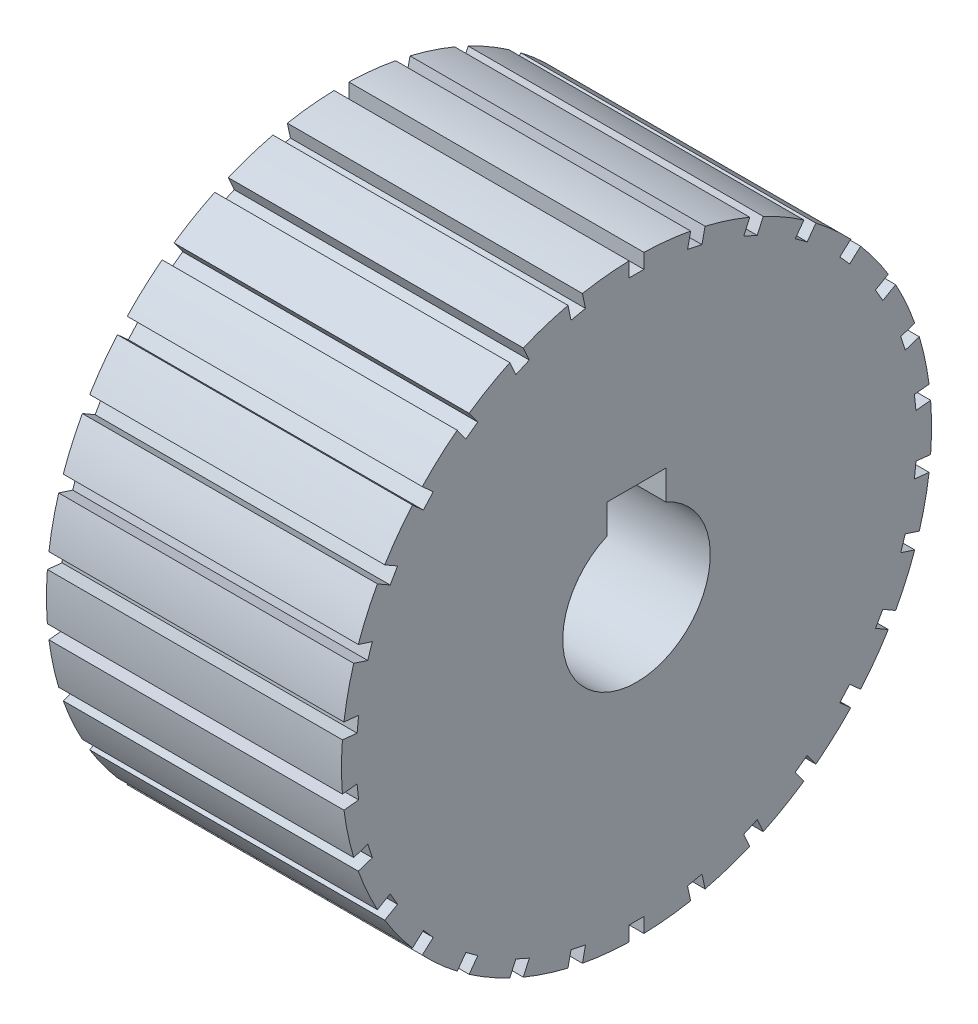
from build123d import *

# Parameters (mm, degrees)
BOSS_EXTRUDE1_DEPTH      = 5
BOSS_EXTRUDE1_DEPTH_BACK = 5
SKETCH1_R                = 10
SKETCH2_W                = 0.5
SKETCH2_H                = 0.6
CUT_EXTRUDE1_DEPTH       = 10
CIRPATTERN1_COUNT        = 30
SKETCH3_R                = 2.5
CUT_EXTRUDE2_DEPTH       = 10
SKETCH4_W                = 2
SKETCH4_H                = 1
CUT_EXTRUDE3_DEPTH       = 10


with BuildPart() as part:
    # Sketch1 → Boss-Extrude1 (new, two sides: drawn at the far end of the back side and taken through both)
    with BuildSketch(Plane(origin=(0, 0, 0), x_dir=(0, 0, -1), z_dir=(1, 0, 0)).offset(-BOSS_EXTRUDE1_DEPTH_BACK)):
        Circle(SKETCH1_R)
    extrude(amount=BOSS_EXTRUDE1_DEPTH + BOSS_EXTRUDE1_DEPTH_BACK)

    # Sketch2 → Cut-Extrude1 (cut)
    with BuildSketch(Plane(origin=(5, 0, 0), x_dir=(0, 0, -1), z_dir=(1, 0, 0))):
        with Locations((0, 9.796874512)):
            Rectangle(SKETCH2_W, SKETCH2_H)
    cut_extrude1 = extrude(amount=-CUT_EXTRUDE1_DEPTH, mode=Mode.SUBTRACT)

    # CirPattern1: Cut-Extrude1 ×30 about axis
    cirpattern1_axis = Axis((0, 0, 0), (1, 0, 0))
    for i in range(1, CIRPATTERN1_COUNT):
        add(cut_extrude1.rotate(cirpattern1_axis, i * 360 / CIRPATTERN1_COUNT), mode=Mode.SUBTRACT)

    # Sketch3 → Cut-Extrude2 (cut)
    with BuildSketch(Plane(origin=(5, 0, 0), x_dir=(0, 0, -1), z_dir=(1, 0, 0))):
        Circle(SKETCH3_R)
    extrude(amount=-CUT_EXTRUDE2_DEPTH, mode=Mode.SUBTRACT)

    # Sketch4 → Cut-Extrude3 (cut)
    with BuildSketch(Plane.ZY.offset(5)):
        with Locations((0, 2.791287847)):
            Rectangle(SKETCH4_W, SKETCH4_H)
    extrude(amount=-CUT_EXTRUDE3_DEPTH, mode=Mode.SUBTRACT)


solid = part.part
